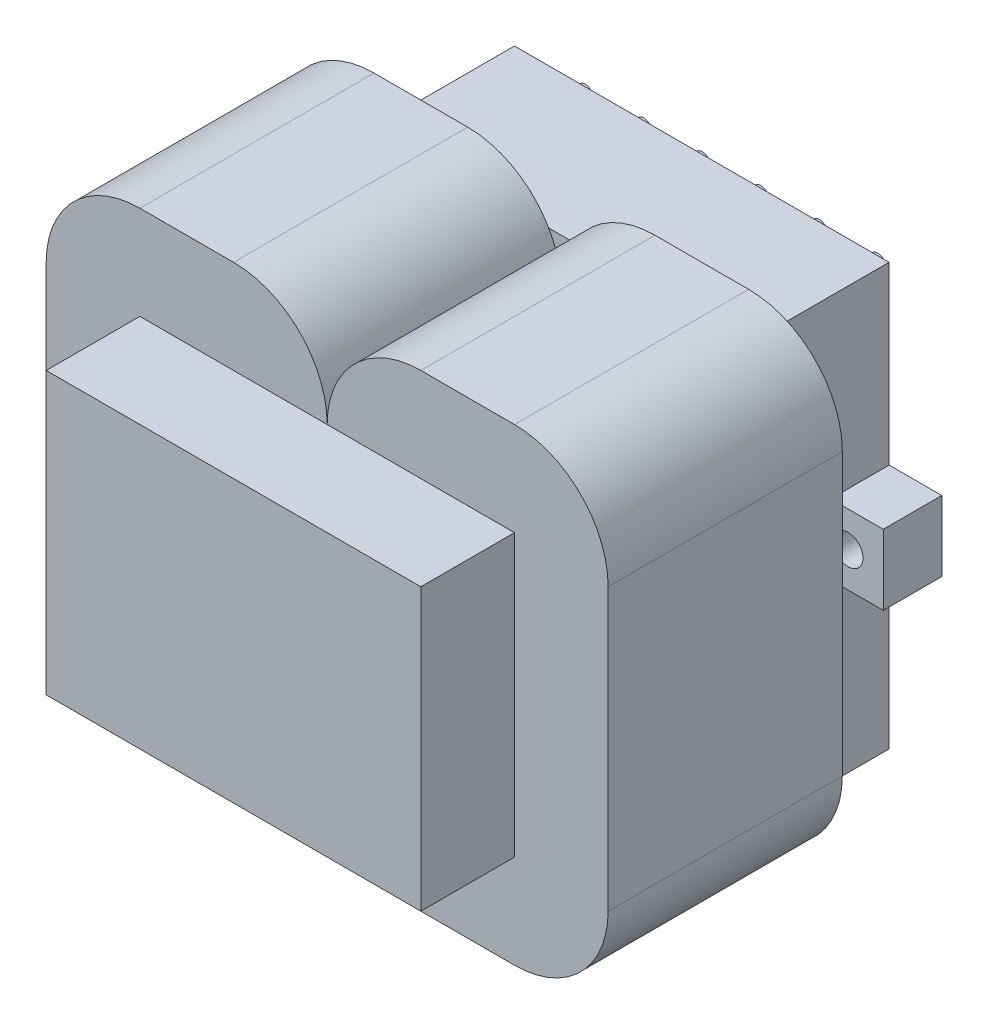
from build123d import *

# Parameters (mm, degrees)
SKETCH1_W              = 32
SKETCH1_H              = 36
BOSS_EXTRUDE1_DEPTH    = 12
SKETCH2_W              = 5
SKETCH2_H              = 6
BOSS_EXTRUDE2_DEPTH    = 4.5
SKETCH3_W              = 5
SKETCH3_H              = 6
BOSS_EXTRUDE3_DEPTH    = 4.5
SKETCH4_R              = 1.27
CUT_EXTRUDE1_DEPTH     = 5
SKETCH5_R              = 0.6604
BOSS_EXTRUDE4_DEPTH    = 2.54
BOSS_EXTRUDE4_2_DEPTH  = 2.54
BOSS_EXTRUDE4_3_DEPTH  = 2.54
BOSS_EXTRUDE4_4_DEPTH  = 2.54
BOSS_EXTRUDE4_5_DEPTH  = 2.54
BOSS_EXTRUDE4_6_DEPTH  = 2.54
BOSS_EXTRUDE4_7_DEPTH  = 2.54
BOSS_EXTRUDE4_8_DEPTH  = 2.54
BOSS_EXTRUDE4_9_DEPTH  = 2.54
BOSS_EXTRUDE4_10_DEPTH = 2.54
BOSS_EXTRUDE4_11_DEPTH = 2.54
BOSS_EXTRUDE4_12_DEPTH = 2.54
SKETCH6_W              = 32
SKETCH6_H              = 24
BOSS_EXTRUDE5_DEPTH    = 28
BOSS_EXTRUDE6_DEPTH    = 20


with BuildPart() as part:
    # Sketch1 → Boss-Extrude1 (new body)
    with BuildSketch(Plane.XY):
        with Locations((0, -2)):
            Rectangle(SKETCH1_W, SKETCH1_H)
    extrude(amount=BOSS_EXTRUDE1_DEPTH)

    # Sketch2 → Boss-Extrude2 (add)
    with BuildSketch(Plane(origin=(16, 0, 0), x_dir=(0, 0, -1), z_dir=(1, 0, 0))):
        with Locations((-2.5, -2)):
            Rectangle(SKETCH2_W, SKETCH2_H)
    extrude(amount=BOSS_EXTRUDE2_DEPTH)

    # Sketch3 → Boss-Extrude3 (add)
    with BuildSketch(Plane.ZY.offset(16)):
        with Locations((2.5, -2)):
            Rectangle(SKETCH3_W, SKETCH3_H)
    extrude(amount=BOSS_EXTRUDE3_DEPTH)

    # Sketch4 → Cut-Extrude1 (cut)
    with BuildSketch(Plane(origin=(0, 0, 0), x_dir=(-1, 0, 0), z_dir=(0, 0, -1))):
        with Locations((-17.5006, -1.99898)):
            Circle(SKETCH4_R)
        with Locations((17.5006, -1.99898)):
            Circle(SKETCH4_R)
    extrude(amount=-CUT_EXTRUDE1_DEPTH, mode=Mode.SUBTRACT)

    # Sketch6 → Boss-Extrude5 (add)
    with BuildSketch(Plane.XY.offset(12)):
        Rectangle(SKETCH6_W, SKETCH6_H)
    extrude(amount=BOSS_EXTRUDE5_DEPTH)


with BuildPart() as body_2:
    # Sketch5 → Boss-Extrude4 (new body)
    with BuildSketch(Plane(origin=(0, 0, 0), x_dir=(-1, 0, 0), z_dir=(0, 0, -1))):
        with Locations((-9.99998, -12.99972)):
            Circle(SKETCH5_R)
    extrude(amount=BOSS_EXTRUDE4_DEPTH)


with BuildPart() as body_3:
    # Sketch5 → Boss-Extrude4 2 (new body)
    with BuildSketch(Plane(origin=(0, 0, 0), x_dir=(-1, 0, 0), z_dir=(0, 0, -1))):
        with Locations((-5.00126, -12.99972)):
            Circle(SKETCH5_R)
    extrude(amount=BOSS_EXTRUDE4_2_DEPTH)


with BuildPart() as body_4:
    # Sketch5 → Boss-Extrude4 3 (new body)
    with BuildSketch(Plane(origin=(0, 0, 0), x_dir=(-1, 0, 0), z_dir=(0, 0, -1))):
        with Locations((-1.50114, -12.99972)):
            Circle(SKETCH5_R)
    extrude(amount=BOSS_EXTRUDE4_3_DEPTH)


with BuildPart() as body_5:
    # Sketch5 → Boss-Extrude4 4 (new body)
    with BuildSketch(Plane(origin=(0, 0, 0), x_dir=(-1, 0, 0), z_dir=(0, 0, -1))):
        with Locations((1.50114, -12.99972)):
            Circle(SKETCH5_R)
    extrude(amount=BOSS_EXTRUDE4_4_DEPTH)


with BuildPart() as body_6:
    # Sketch5 → Boss-Extrude4 5 (new body)
    with BuildSketch(Plane(origin=(0, 0, 0), x_dir=(-1, 0, 0), z_dir=(0, 0, -1))):
        with Locations((5.00126, -12.99972)):
            Circle(SKETCH5_R)
    extrude(amount=BOSS_EXTRUDE4_5_DEPTH)


with BuildPart() as body_7:
    # Sketch5 → Boss-Extrude4 6 (new body)
    with BuildSketch(Plane(origin=(0, 0, 0), x_dir=(-1, 0, 0), z_dir=(0, 0, -1))):
        with Locations((9.99998, -12.99972)):
            Circle(SKETCH5_R)
    extrude(amount=BOSS_EXTRUDE4_6_DEPTH)


with BuildPart() as body_8:
    # Sketch5 → Boss-Extrude4 7 (new body)
    with BuildSketch(Plane(origin=(0, 0, 0), x_dir=(-1, 0, 0), z_dir=(0, 0, -1))):
        with Locations((-12.49934, 12.99972)):
            Circle(SKETCH5_R)
    extrude(amount=BOSS_EXTRUDE4_7_DEPTH)


with BuildPart() as body_9:
    # Sketch5 → Boss-Extrude4 8 (new body)
    with BuildSketch(Plane(origin=(0, 0, 0), x_dir=(-1, 0, 0), z_dir=(0, 0, -1))):
        with Locations((-7.50062, 12.99972)):
            Circle(SKETCH5_R)
    extrude(amount=BOSS_EXTRUDE4_8_DEPTH)


with BuildPart() as body_10:
    # Sketch5 → Boss-Extrude4 9 (new body)
    with BuildSketch(Plane(origin=(0, 0, 0), x_dir=(-1, 0, 0), z_dir=(0, 0, -1))):
        with Locations((-2.49936, 12.99972)):
            Circle(SKETCH5_R)
    extrude(amount=BOSS_EXTRUDE4_9_DEPTH)


with BuildPart() as body_11:
    # Sketch5 → Boss-Extrude4 10 (new body)
    with BuildSketch(Plane(origin=(0, 0, 0), x_dir=(-1, 0, 0), z_dir=(0, 0, -1))):
        with Locations((2.49936, 12.99972)):
            Circle(SKETCH5_R)
    extrude(amount=BOSS_EXTRUDE4_10_DEPTH)


with BuildPart() as body_12:
    # Sketch5 → Boss-Extrude4 11 (new body)
    with BuildSketch(Plane(origin=(0, 0, 0), x_dir=(-1, 0, 0), z_dir=(0, 0, -1))):
        with Locations((7.50062, 12.99972)):
            Circle(SKETCH5_R)
    extrude(amount=BOSS_EXTRUDE4_11_DEPTH)


with BuildPart() as body_13:
    # Sketch5 → Boss-Extrude4 12 (new body)
    with BuildSketch(Plane(origin=(0, 0, 0), x_dir=(-1, 0, 0), z_dir=(0, 0, -1))):
        with Locations((12.49934, 12.99972)):
            Circle(SKETCH5_R)
    extrude(amount=BOSS_EXTRUDE4_12_DEPTH)


with BuildPart() as body_14:
    # Sketch7 → Boss-Extrude6 (new body)
    with BuildSketch(Plane.XY.offset(12)):
        with BuildLine():
            Line((-16, -20), (-8, -20))
            ThreePointArc((-8, -20), (-2.343145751, -17.656854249), (0, -12))
            ThreePointArc((0, -12), (2.343145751, -17.656854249), (8, -20))
            Line((8, -20), (16, -20))
            ThreePointArc((16, -20), (21.656854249, -17.656854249), (24, -12))
            Line((24, -12), (24, 12))
            ThreePointArc((24, 12), (21.656854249, 17.656854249), (16, 20))
            Line((16, 20), (8, 20))
            ThreePointArc((8, 20), (2.343145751, 17.656854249), (0, 12))
            ThreePointArc((0, 12), (-2.343145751, 17.656854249), (-8, 20))
            Line((-8, 20), (-16, 20))
            ThreePointArc((-16, 20), (-21.656854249, 17.656854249), (-24, 12))
            Line((-24, 12), (-24, -12))
            ThreePointArc((-24, -12), (-21.656854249, -17.656854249), (-16, -20))
        make_face()
    extrude(amount=BOSS_EXTRUDE6_DEPTH)


solid = Compound([part.part, body_2.part, body_3.part, body_4.part, body_5.part, body_6.part, body_7.part, body_8.part, body_9.part, body_10.part, body_11.part, body_12.part, body_13.part, body_14.part])
